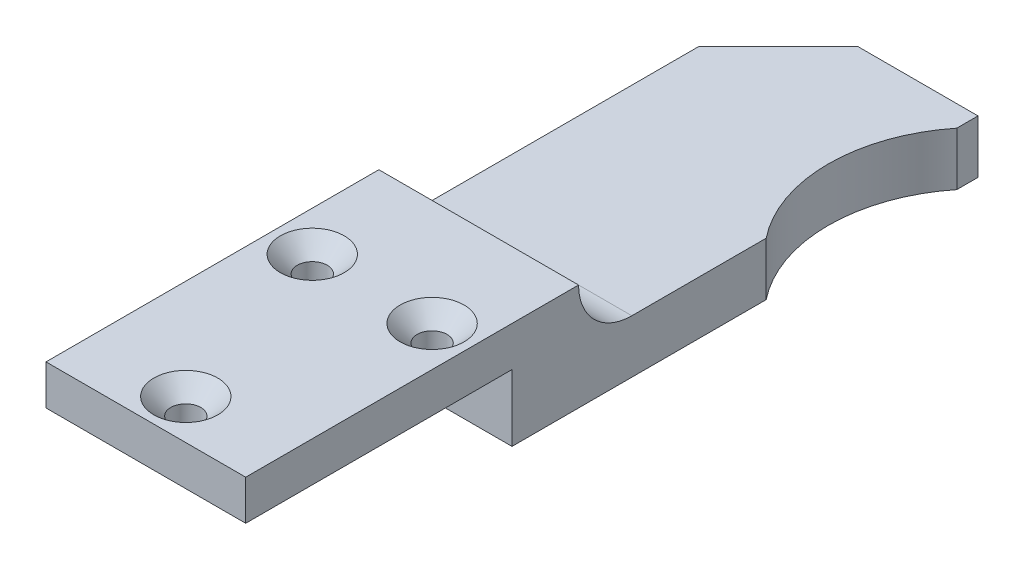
ISO-10303-21;
HEADER;
FILE_DESCRIPTION(('STEP AP214'),'2;1');
FILE_NAME('part.step','',(''),(''),'','','');
FILE_SCHEMA(('AUTOMOTIVE_DESIGN { 1 0 10303 214 1 1 1 1 }'));
ENDSEC;
DATA;
#1=APPLICATION_CONTEXT('core data for automotive mechanical design processes');
#2=APPLICATION_PROTOCOL_DEFINITION('international standard','automotive_design',2000,#1);
#3=PRODUCT_CONTEXT('',#1,'mechanical');
#4=PRODUCT('Part','Part','',(#3));
#5=PRODUCT_RELATED_PRODUCT_CATEGORY('part','',(#4));
#6=PRODUCT_DEFINITION_FORMATION('','',#4);
#7=PRODUCT_DEFINITION_CONTEXT('part definition',#1,'design');
#8=PRODUCT_DEFINITION('design','',#6,#7);
#9=PRODUCT_DEFINITION_SHAPE('','',#8);
#10=(LENGTH_UNIT() NAMED_UNIT(*) SI_UNIT(.MILLI.,.METRE.));
#11=(NAMED_UNIT(*) PLANE_ANGLE_UNIT() SI_UNIT($,.RADIAN.));
#12=(NAMED_UNIT(*) SI_UNIT($,.STERADIAN.) SOLID_ANGLE_UNIT());
#13=UNCERTAINTY_MEASURE_WITH_UNIT(LENGTH_MEASURE(1.E-05),#10,'distance_accuracy_value','');
#14=(GEOMETRIC_REPRESENTATION_CONTEXT(3) GLOBAL_UNCERTAINTY_ASSIGNED_CONTEXT((#13)) GLOBAL_UNIT_ASSIGNED_CONTEXT((#10,
#11,#12)) REPRESENTATION_CONTEXT('',''));
#15=CARTESIAN_POINT('',(0.,0.,0.));
#16=DIRECTION('',(0.,0.,1.));
#17=DIRECTION('',(1.,0.,0.));
#18=AXIS2_PLACEMENT_3D('',#15,#16,#17);
#19=CARTESIAN_POINT('',(-8.99999999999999,15.9999999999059,21.));
#20=DIRECTION('',(0.,1.,0.));
#21=DIRECTION('',(0.,0.,1.));
#22=AXIS2_PLACEMENT_3D('',#19,#20,#21);
#23=CONICAL_SURFACE('',#22,4.79999999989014,0.785398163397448);
#24=CARTESIAN_POINT('',(-8.99999999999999,15.9999999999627,21.));
#25=DIRECTION('',(0.,1.,0.));
#26=DIRECTION('',(0.,0.,1.));
#27=AXIS2_PLACEMENT_3D('',#24,#25,#26);
#28=CIRCLE('',#27,4.79999999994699);
#29=CARTESIAN_POINT('',(-8.99999999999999,15.9999999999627,25.799999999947));
#30=VERTEX_POINT('',#29);
#31=EDGE_CURVE('E20',#30,#30,#28,.F.);
#32=ORIENTED_EDGE('',*,*,#31,.F.);
#33=EDGE_LOOP('',(#32));
#34=FACE_BOUND('',#33,.T.);
#35=CARTESIAN_POINT('',(-8.99999999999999,13.45,21.));
#36=DIRECTION('',(0.,1.,0.));
#37=DIRECTION('',(0.,0.,1.));
#38=AXIS2_PLACEMENT_3D('',#35,#36,#37);
#39=CIRCLE('',#38,2.25);
#40=CARTESIAN_POINT('',(-8.99999999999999,13.45,23.25));
#41=VERTEX_POINT('',#40);
#42=EDGE_CURVE('E217',#41,#41,#39,.F.);
#43=ORIENTED_EDGE('',*,*,#42,.T.);
#44=EDGE_LOOP('',(#43));
#45=FACE_BOUND('',#44,.T.);
#46=ADVANCED_FACE('F17',(#34,#45),#23,.F.);
#47=CARTESIAN_POINT('',(9.00000000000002,15.9999999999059,21.));
#48=DIRECTION('',(0.,1.,0.));
#49=DIRECTION('',(0.,0.,1.));
#50=AXIS2_PLACEMENT_3D('',#47,#48,#49);
#51=CONICAL_SURFACE('',#50,4.79999999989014,0.785398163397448);
#52=CARTESIAN_POINT('',(9.00000000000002,15.9999999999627,21.));
#53=DIRECTION('',(0.,1.,0.));
#54=DIRECTION('',(0.,0.,1.));
#55=AXIS2_PLACEMENT_3D('',#52,#53,#54);
#56=CIRCLE('',#55,4.79999999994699);
#57=CARTESIAN_POINT('',(9.00000000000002,15.9999999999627,25.799999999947));
#58=VERTEX_POINT('',#57);
#59=EDGE_CURVE('E235',#58,#58,#56,.F.);
#60=ORIENTED_EDGE('',*,*,#59,.F.);
#61=EDGE_LOOP('',(#60));
#62=FACE_BOUND('',#61,.T.);
#63=CARTESIAN_POINT('',(9.00000000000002,13.45,21.));
#64=DIRECTION('',(0.,1.,0.));
#65=DIRECTION('',(0.,0.,1.));
#66=AXIS2_PLACEMENT_3D('',#63,#64,#65);
#67=CIRCLE('',#66,2.25);
#68=CARTESIAN_POINT('',(9.00000000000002,13.45,23.25));
#69=VERTEX_POINT('',#68);
#70=EDGE_CURVE('E214',#69,#69,#67,.F.);
#71=ORIENTED_EDGE('',*,*,#70,.T.);
#72=EDGE_LOOP('',(#71));
#73=FACE_BOUND('',#72,.T.);
#74=ADVANCED_FACE('F245',(#62,#73),#51,.F.);
#75=CARTESIAN_POINT('',(0.,15.9999999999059,49.));
#76=DIRECTION('',(0.,1.,0.));
#77=DIRECTION('',(0.,0.,1.));
#78=AXIS2_PLACEMENT_3D('',#75,#76,#77);
#79=CONICAL_SURFACE('',#78,4.79999999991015,0.785398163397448);
#80=CARTESIAN_POINT('',(0.,16.0000000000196,49.));
#81=DIRECTION('',(0.,1.,0.));
#82=DIRECTION('',(0.,0.,1.));
#83=AXIS2_PLACEMENT_3D('',#80,#81,#82);
#84=CIRCLE('',#83,4.80000000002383);
#85=CARTESIAN_POINT('',(0.,16.0000000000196,53.8000000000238));
#86=VERTEX_POINT('',#85);
#87=EDGE_CURVE('E108',#86,#86,#84,.F.);
#88=ORIENTED_EDGE('',*,*,#87,.F.);
#89=EDGE_LOOP('',(#88));
#90=FACE_BOUND('',#89,.T.);
#91=CARTESIAN_POINT('',(0.,13.45,49.));
#92=DIRECTION('',(0.,1.,0.));
#93=DIRECTION('',(0.,0.,1.));
#94=AXIS2_PLACEMENT_3D('',#91,#92,#93);
#95=CIRCLE('',#94,2.25);
#96=CARTESIAN_POINT('',(0.,13.45,51.25));
#97=VERTEX_POINT('',#96);
#98=EDGE_CURVE('E211',#97,#97,#95,.F.);
#99=ORIENTED_EDGE('',*,*,#98,.T.);
#100=EDGE_LOOP('',(#99));
#101=FACE_BOUND('',#100,.T.);
#102=ADVANCED_FACE('F251',(#90,#101),#79,.F.);
#103=CARTESIAN_POINT('',(-8.99999999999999,16.,21.));
#104=DIRECTION('',(0.,1.,0.));
#105=DIRECTION('',(0.,0.,1.));
#106=AXIS2_PLACEMENT_3D('',#103,#104,#105);
#107=CYLINDRICAL_SURFACE('',#106,2.25);
#108=CARTESIAN_POINT('',(-8.99999999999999,10.,21.));
#109=DIRECTION('',(0.,1.,0.));
#110=DIRECTION('',(0.,0.,1.));
#111=AXIS2_PLACEMENT_3D('',#108,#109,#110);
#112=CIRCLE('',#111,2.25);
#113=CARTESIAN_POINT('',(-8.99999999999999,10.,23.25));
#114=VERTEX_POINT('',#113);
#115=EDGE_CURVE('E188',#114,#114,#112,.F.);
#116=ORIENTED_EDGE('',*,*,#115,.T.);
#117=EDGE_LOOP('',(#116));
#118=FACE_BOUND('',#117,.T.);
#119=ORIENTED_EDGE('',*,*,#42,.F.);
#120=EDGE_LOOP('',(#119));
#121=FACE_BOUND('',#120,.T.);
#122=ADVANCED_FACE('F248',(#118,#121),#107,.F.);
#123=CARTESIAN_POINT('',(9.00000000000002,16.,21.));
#124=DIRECTION('',(0.,1.,0.));
#125=DIRECTION('',(0.,0.,1.));
#126=AXIS2_PLACEMENT_3D('',#123,#124,#125);
#127=CYLINDRICAL_SURFACE('',#126,2.25);
#128=CARTESIAN_POINT('',(9.00000000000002,10.,21.));
#129=DIRECTION('',(0.,1.,0.));
#130=DIRECTION('',(0.,0.,1.));
#131=AXIS2_PLACEMENT_3D('',#128,#129,#130);
#132=CIRCLE('',#131,2.25);
#133=CARTESIAN_POINT('',(9.00000000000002,10.,23.25));
#134=VERTEX_POINT('',#133);
#135=EDGE_CURVE('E229',#134,#134,#132,.F.);
#136=ORIENTED_EDGE('',*,*,#135,.T.);
#137=EDGE_LOOP('',(#136));
#138=FACE_BOUND('',#137,.T.);
#139=ORIENTED_EDGE('',*,*,#70,.F.);
#140=EDGE_LOOP('',(#139));
#141=FACE_BOUND('',#140,.T.);
#142=ADVANCED_FACE('F250',(#138,#141),#127,.F.);
#143=CARTESIAN_POINT('',(0.,16.,49.));
#144=DIRECTION('',(0.,1.,0.));
#145=DIRECTION('',(0.,0.,1.));
#146=AXIS2_PLACEMENT_3D('',#143,#144,#145);
#147=CYLINDRICAL_SURFACE('',#146,2.25);
#148=CARTESIAN_POINT('',(0.,10.,49.));
#149=DIRECTION('',(0.,1.,0.));
#150=DIRECTION('',(0.,0.,1.));
#151=AXIS2_PLACEMENT_3D('',#148,#149,#150);
#152=CIRCLE('',#151,2.25);
#153=CARTESIAN_POINT('',(0.,10.,51.25));
#154=VERTEX_POINT('',#153);
#155=EDGE_CURVE('E179',#154,#154,#152,.F.);
#156=ORIENTED_EDGE('',*,*,#155,.T.);
#157=EDGE_LOOP('',(#156));
#158=FACE_BOUND('',#157,.T.);
#159=ORIENTED_EDGE('',*,*,#98,.F.);
#160=EDGE_LOOP('',(#159));
#161=FACE_BOUND('',#160,.T.);
#162=ADVANCED_FACE('F259',(#158,#161),#147,.F.);
#163=CARTESIAN_POINT('',(-31.6877512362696,16.,-3.));
#164=DIRECTION('',(1.,0.,0.));
#165=DIRECTION('',(0.,0.,-1.));
#166=AXIS2_PLACEMENT_3D('',#163,#164,#165);
#167=CYLINDRICAL_SURFACE('',#166,8.);
#168=DIRECTION('',(1.,0.,0.));
#169=VECTOR('',#168,1.);
#170=CARTESIAN_POINT('',(0.,16.,4.99999999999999));
#171=LINE('',#170,#169);
#172=CARTESIAN_POINT('',(15.,16.,4.99999999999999));
#173=VERTEX_POINT('',#172);
#174=CARTESIAN_POINT('',(-15.,16.,4.99999999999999));
#175=VERTEX_POINT('',#174);
#176=EDGE_CURVE('E97',#173,#175,#171,.F.);
#177=ORIENTED_EDGE('',*,*,#176,.F.);
#178=CARTESIAN_POINT('',(15.,16.,-3.00000000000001));
#179=DIRECTION('',(1.,0.,0.));
#180=DIRECTION('',(0.,0.,-1.));
#181=AXIS2_PLACEMENT_3D('',#178,#179,#180);
#182=CIRCLE('',#181,8.);
#183=CARTESIAN_POINT('',(15.,7.99999999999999,-3.00000000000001));
#184=VERTEX_POINT('',#183);
#185=EDGE_CURVE('E101',#173,#184,#182,.T.);
#186=ORIENTED_EDGE('',*,*,#185,.T.);
#187=DIRECTION('',(1.,0.,0.));
#188=VECTOR('',#187,1.);
#189=CARTESIAN_POINT('',(-15.,7.99999999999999,-3.));
#190=LINE('',#189,#188);
#191=CARTESIAN_POINT('',(-15.,8.,-3.));
#192=VERTEX_POINT('',#191);
#193=EDGE_CURVE('E154',#184,#192,#190,.F.);
#194=ORIENTED_EDGE('',*,*,#193,.T.);
#195=CARTESIAN_POINT('',(-15.,16.,-3.));
#196=DIRECTION('',(1.,0.,0.));
#197=DIRECTION('',(0.,0.,-1.));
#198=AXIS2_PLACEMENT_3D('',#195,#196,#197);
#199=CIRCLE('',#198,8.);
#200=EDGE_CURVE('E102',#192,#175,#199,.F.);
#201=ORIENTED_EDGE('',*,*,#200,.T.);
#202=EDGE_LOOP('',(#177,#186,#194,#201));
#203=FACE_BOUND('',#202,.T.);
#204=ADVANCED_FACE('F99',(#203),#167,.F.);
#205=CARTESIAN_POINT('',(0.,16.,0.));
#206=DIRECTION('',(0.,1.,0.));
#207=DIRECTION('',(0.,0.,1.));
#208=AXIS2_PLACEMENT_3D('',#205,#206,#207);
#209=PLANE('',#208);
#210=DIRECTION('',(0.,0.,-1.));
#211=VECTOR('',#210,1.);
#212=CARTESIAN_POINT('',(-15.,16.,-55.));
#213=LINE('',#212,#211);
#214=CARTESIAN_POINT('',(-15.,16.,55.));
#215=VERTEX_POINT('',#214);
#216=EDGE_CURVE('E184',#175,#215,#213,.F.);
#217=ORIENTED_EDGE('',*,*,#216,.T.);
#218=DIRECTION('',(-1.,0.,0.));
#219=VECTOR('',#218,1.);
#220=CARTESIAN_POINT('',(-15.,16.,55.));
#221=LINE('',#220,#219);
#222=CARTESIAN_POINT('',(15.,16.,55.));
#223=VERTEX_POINT('',#222);
#224=EDGE_CURVE('E107',#215,#223,#221,.F.);
#225=ORIENTED_EDGE('',*,*,#224,.T.);
#226=DIRECTION('',(0.,0.,1.));
#227=VECTOR('',#226,1.);
#228=CARTESIAN_POINT('',(15.,16.,-55.));
#229=LINE('',#228,#227);
#230=EDGE_CURVE('E115',#223,#173,#229,.F.);
#231=ORIENTED_EDGE('',*,*,#230,.T.);
#232=ORIENTED_EDGE('',*,*,#176,.T.);
#233=EDGE_LOOP('',(#217,#225,#231,#232));
#234=FACE_BOUND('',#233,.T.);
#235=ORIENTED_EDGE('',*,*,#87,.T.);
#236=EDGE_LOOP('',(#235));
#237=FACE_BOUND('',#236,.T.);
#238=ORIENTED_EDGE('',*,*,#59,.T.);
#239=EDGE_LOOP('',(#238));
#240=FACE_BOUND('',#239,.T.);
#241=ORIENTED_EDGE('',*,*,#31,.T.);
#242=EDGE_LOOP('',(#241));
#243=FACE_BOUND('',#242,.T.);
#244=ADVANCED_FACE('F121',(#234,#237,#240,#243),#209,.T.);
#245=CARTESIAN_POINT('',(-15.,16.,55.));
#246=DIRECTION('',(0.,0.,-1.));
#247=DIRECTION('',(-1.,0.,0.));
#248=AXIS2_PLACEMENT_3D('',#245,#246,#247);
#249=PLANE('',#248);
#250=DIRECTION('',(1.,0.,0.));
#251=VECTOR('',#250,1.);
#252=CARTESIAN_POINT('',(-15.,10.,55.));
#253=LINE('',#252,#251);
#254=CARTESIAN_POINT('',(-15.,10.,55.));
#255=VERTEX_POINT('',#254);
#256=CARTESIAN_POINT('',(15.,10.,55.));
#257=VERTEX_POINT('',#256);
#258=EDGE_CURVE('E156',#255,#257,#253,.T.);
#259=ORIENTED_EDGE('',*,*,#258,.T.);
#260=DIRECTION('',(0.,1.,0.));
#261=VECTOR('',#260,1.);
#262=CARTESIAN_POINT('',(15.,16.,55.));
#263=LINE('',#262,#261);
#264=EDGE_CURVE('E123',#257,#223,#263,.T.);
#265=ORIENTED_EDGE('',*,*,#264,.T.);
#266=ORIENTED_EDGE('',*,*,#224,.F.);
#267=DIRECTION('',(0.,1.,0.));
#268=VECTOR('',#267,1.);
#269=CARTESIAN_POINT('',(-15.,16.,55.));
#270=LINE('',#269,#268);
#271=EDGE_CURVE('E175',#215,#255,#270,.F.);
#272=ORIENTED_EDGE('',*,*,#271,.T.);
#273=EDGE_LOOP('',(#259,#265,#266,#272));
#274=FACE_BOUND('',#273,.T.);
#275=ADVANCED_FACE('F304',(#274),#249,.F.);
#276=CARTESIAN_POINT('',(-15.,10.,55.));
#277=DIRECTION('',(0.,1.,0.));
#278=DIRECTION('',(0.,0.,1.));
#279=AXIS2_PLACEMENT_3D('',#276,#277,#278);
#280=PLANE('',#279);
#281=ORIENTED_EDGE('',*,*,#258,.F.);
#282=DIRECTION('',(0.,0.,-1.));
#283=VECTOR('',#282,1.);
#284=CARTESIAN_POINT('',(-15.,10.,-55.));
#285=LINE('',#284,#283);
#286=CARTESIAN_POINT('',(-15.,10.,15.));
#287=VERTEX_POINT('',#286);
#288=EDGE_CURVE('E149',#255,#287,#285,.T.);
#289=ORIENTED_EDGE('',*,*,#288,.T.);
#290=DIRECTION('',(-1.,0.,0.));
#291=VECTOR('',#290,1.);
#292=CARTESIAN_POINT('',(-15.,10.,15.));
#293=LINE('',#292,#291);
#294=CARTESIAN_POINT('',(15.,10.,15.));
#295=VERTEX_POINT('',#294);
#296=EDGE_CURVE('E134',#287,#295,#293,.F.);
#297=ORIENTED_EDGE('',*,*,#296,.T.);
#298=DIRECTION('',(0.,0.,1.));
#299=VECTOR('',#298,1.);
#300=CARTESIAN_POINT('',(15.,10.,-55.));
#301=LINE('',#300,#299);
#302=EDGE_CURVE('E125',#295,#257,#301,.T.);
#303=ORIENTED_EDGE('',*,*,#302,.T.);
#304=EDGE_LOOP('',(#281,#289,#297,#303));
#305=FACE_BOUND('',#304,.T.);
#306=ORIENTED_EDGE('',*,*,#155,.F.);
#307=EDGE_LOOP('',(#306));
#308=FACE_BOUND('',#307,.T.);
#309=ORIENTED_EDGE('',*,*,#135,.F.);
#310=EDGE_LOOP('',(#309));
#311=FACE_BOUND('',#310,.T.);
#312=ORIENTED_EDGE('',*,*,#115,.F.);
#313=EDGE_LOOP('',(#312));
#314=FACE_BOUND('',#313,.T.);
#315=ADVANCED_FACE('F300',(#305,#308,#311,#314),#280,.F.);
#316=CARTESIAN_POINT('',(-15.,8.,-55.));
#317=DIRECTION('',(0.,-1.,0.));
#318=DIRECTION('',(0.,0.,-1.));
#319=AXIS2_PLACEMENT_3D('',#316,#317,#318);
#320=PLANE('',#319);
#321=DIRECTION('',(0.707106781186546,0.,-0.707106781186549));
#322=VECTOR('',#321,1.);
#323=CARTESIAN_POINT('',(-3.,8.,-55.));
#324=LINE('',#323,#322);
#325=CARTESIAN_POINT('',(-3.,8.,-55.));
#326=VERTEX_POINT('',#325);
#327=CARTESIAN_POINT('',(-15.,8.,-43.));
#328=VERTEX_POINT('',#327);
#329=EDGE_CURVE('E160',#326,#328,#324,.F.);
#330=ORIENTED_EDGE('',*,*,#329,.T.);
#331=DIRECTION('',(0.,0.,-1.));
#332=VECTOR('',#331,1.);
#333=CARTESIAN_POINT('',(-15.,8.,-55.));
#334=LINE('',#333,#332);
#335=EDGE_CURVE('E143',#328,#192,#334,.F.);
#336=ORIENTED_EDGE('',*,*,#335,.T.);
#337=ORIENTED_EDGE('',*,*,#193,.F.);
#338=DIRECTION('',(0.,0.,1.));
#339=VECTOR('',#338,1.);
#340=CARTESIAN_POINT('',(15.,7.99999999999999,-55.));
#341=LINE('',#340,#339);
#342=CARTESIAN_POINT('',(15.,8.,-23.1821789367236));
#343=VERTEX_POINT('',#342);
#344=EDGE_CURVE('E118',#184,#343,#341,.F.);
#345=ORIENTED_EDGE('',*,*,#344,.T.);
#346=CARTESIAN_POINT('',(33.,8.,-37.5));
#347=DIRECTION('',(0.,1.,0.));
#348=DIRECTION('',(0.,0.,1.));
#349=AXIS2_PLACEMENT_3D('',#346,#347,#348);
#350=CIRCLE('',#349,23.);
#351=CARTESIAN_POINT('',(15.,8.,-51.8178210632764));
#352=VERTEX_POINT('',#351);
#353=EDGE_CURVE('E225',#343,#352,#350,.F.);
#354=ORIENTED_EDGE('',*,*,#353,.T.);
#355=DIRECTION('',(0.,0.,1.));
#356=VECTOR('',#355,1.);
#357=CARTESIAN_POINT('',(15.,8.,-55.));
#358=LINE('',#357,#356);
#359=CARTESIAN_POINT('',(15.,8.,-55.));
#360=VERTEX_POINT('',#359);
#361=EDGE_CURVE('E200',#352,#360,#358,.F.);
#362=ORIENTED_EDGE('',*,*,#361,.T.);
#363=DIRECTION('',(1.,0.,0.));
#364=VECTOR('',#363,1.);
#365=CARTESIAN_POINT('',(-15.,8.,-55.));
#366=LINE('',#365,#364);
#367=EDGE_CURVE('E193',#360,#326,#366,.F.);
#368=ORIENTED_EDGE('',*,*,#367,.T.);
#369=EDGE_LOOP('',(#330,#336,#337,#345,#354,#362,#368));
#370=FACE_BOUND('',#369,.T.);
#371=ADVANCED_FACE('F296',(#370),#320,.F.);
#372=CARTESIAN_POINT('',(-15.,0.,15.));
#373=DIRECTION('',(0.,0.,-1.));
#374=DIRECTION('',(-1.,0.,0.));
#375=AXIS2_PLACEMENT_3D('',#372,#373,#374);
#376=PLANE('',#375);
#377=DIRECTION('',(0.,1.,0.));
#378=VECTOR('',#377,1.);
#379=CARTESIAN_POINT('',(-15.,16.,15.));
#380=LINE('',#379,#378);
#381=CARTESIAN_POINT('',(-15.,0.,15.));
#382=VERTEX_POINT('',#381);
#383=EDGE_CURVE('E146',#287,#382,#380,.F.);
#384=ORIENTED_EDGE('',*,*,#383,.T.);
#385=DIRECTION('',(1.,0.,0.));
#386=VECTOR('',#385,1.);
#387=CARTESIAN_POINT('',(0.,0.,15.));
#388=LINE('',#387,#386);
#389=CARTESIAN_POINT('',(15.,0.,15.));
#390=VERTEX_POINT('',#389);
#391=EDGE_CURVE('E139',#382,#390,#388,.T.);
#392=ORIENTED_EDGE('',*,*,#391,.T.);
#393=DIRECTION('',(0.,1.,0.));
#394=VECTOR('',#393,1.);
#395=CARTESIAN_POINT('',(15.,16.,15.));
#396=LINE('',#395,#394);
#397=EDGE_CURVE('E133',#390,#295,#396,.T.);
#398=ORIENTED_EDGE('',*,*,#397,.T.);
#399=ORIENTED_EDGE('',*,*,#296,.F.);
#400=EDGE_LOOP('',(#384,#392,#398,#399));
#401=FACE_BOUND('',#400,.T.);
#402=ADVANCED_FACE('F293',(#401),#376,.F.);
#403=CARTESIAN_POINT('',(15.,16.,-55.));
#404=DIRECTION('',(-1.,0.,0.));
#405=DIRECTION('',(0.,0.,1.));
#406=AXIS2_PLACEMENT_3D('',#403,#404,#405);
#407=PLANE('',#406);
#408=ORIENTED_EDGE('',*,*,#230,.F.);
#409=ORIENTED_EDGE('',*,*,#264,.F.);
#410=ORIENTED_EDGE('',*,*,#302,.F.);
#411=ORIENTED_EDGE('',*,*,#397,.F.);
#412=DIRECTION('',(0.,0.,1.));
#413=VECTOR('',#412,1.);
#414=CARTESIAN_POINT('',(15.,0.,0.));
#415=LINE('',#414,#413);
#416=CARTESIAN_POINT('',(15.,0.,-23.1821789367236));
#417=VERTEX_POINT('',#416);
#418=EDGE_CURVE('E142',#390,#417,#415,.F.);
#419=ORIENTED_EDGE('',*,*,#418,.T.);
#420=DIRECTION('',(0.,1.,0.));
#421=VECTOR('',#420,1.);
#422=CARTESIAN_POINT('',(15.,0.,-23.1821789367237));
#423=LINE('',#422,#421);
#424=EDGE_CURVE('E119',#417,#343,#423,.T.);
#425=ORIENTED_EDGE('',*,*,#424,.T.);
#426=ORIENTED_EDGE('',*,*,#344,.F.);
#427=ORIENTED_EDGE('',*,*,#185,.F.);
#428=EDGE_LOOP('',(#408,#409,#410,#411,#419,#425,#426,#427));
#429=FACE_BOUND('',#428,.T.);
#430=ADVANCED_FACE('F113',(#429),#407,.F.);
#431=CARTESIAN_POINT('',(33.,0.,-37.5));
#432=DIRECTION('',(0.,1.,0.));
#433=DIRECTION('',(0.,0.,1.));
#434=AXIS2_PLACEMENT_3D('',#431,#432,#433);
#435=CYLINDRICAL_SURFACE('',#434,23.);
#436=DIRECTION('',(0.,1.,0.));
#437=VECTOR('',#436,1.);
#438=CARTESIAN_POINT('',(15.,16.,-51.8178210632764));
#439=LINE('',#438,#437);
#440=CARTESIAN_POINT('',(15.,0.,-51.8178210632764));
#441=VERTEX_POINT('',#440);
#442=EDGE_CURVE('E202',#441,#352,#439,.T.);
#443=ORIENTED_EDGE('',*,*,#442,.T.);
#444=ORIENTED_EDGE('',*,*,#353,.F.);
#445=ORIENTED_EDGE('',*,*,#424,.F.);
#446=CARTESIAN_POINT('',(33.,0.,-37.5));
#447=DIRECTION('',(0.,1.,0.));
#448=DIRECTION('',(0.,0.,1.));
#449=AXIS2_PLACEMENT_3D('',#446,#447,#448);
#450=CIRCLE('',#449,23.);
#451=EDGE_CURVE('E220',#417,#441,#450,.F.);
#452=ORIENTED_EDGE('',*,*,#451,.T.);
#453=EDGE_LOOP('',(#443,#444,#445,#452));
#454=FACE_BOUND('',#453,.T.);
#455=ADVANCED_FACE('F286',(#454),#435,.F.);
#456=CARTESIAN_POINT('',(15.,16.,-55.));
#457=DIRECTION('',(-1.,0.,0.));
#458=DIRECTION('',(0.,0.,1.));
#459=AXIS2_PLACEMENT_3D('',#456,#457,#458);
#460=PLANE('',#459);
#461=ORIENTED_EDGE('',*,*,#442,.F.);
#462=DIRECTION('',(0.,0.,1.));
#463=VECTOR('',#462,1.);
#464=CARTESIAN_POINT('',(15.,0.,0.));
#465=LINE('',#464,#463);
#466=CARTESIAN_POINT('',(15.,0.,-55.));
#467=VERTEX_POINT('',#466);
#468=EDGE_CURVE('E223',#441,#467,#465,.F.);
#469=ORIENTED_EDGE('',*,*,#468,.T.);
#470=DIRECTION('',(0.,1.,0.));
#471=VECTOR('',#470,1.);
#472=CARTESIAN_POINT('',(15.,16.,-55.));
#473=LINE('',#472,#471);
#474=EDGE_CURVE('E197',#467,#360,#473,.T.);
#475=ORIENTED_EDGE('',*,*,#474,.T.);
#476=ORIENTED_EDGE('',*,*,#361,.F.);
#477=EDGE_LOOP('',(#461,#469,#475,#476));
#478=FACE_BOUND('',#477,.T.);
#479=ADVANCED_FACE('F282',(#478),#460,.F.);
#480=CARTESIAN_POINT('',(-15.,16.,-55.));
#481=DIRECTION('',(0.,0.,1.));
#482=DIRECTION('',(1.,0.,0.));
#483=AXIS2_PLACEMENT_3D('',#480,#481,#482);
#484=PLANE('',#483);
#485=DIRECTION('',(0.,1.,0.));
#486=VECTOR('',#485,1.);
#487=CARTESIAN_POINT('',(-3.,16.,-55.));
#488=LINE('',#487,#486);
#489=CARTESIAN_POINT('',(-3.,0.,-55.));
#490=VERTEX_POINT('',#489);
#491=EDGE_CURVE('E162',#490,#326,#488,.T.);
#492=ORIENTED_EDGE('',*,*,#491,.T.);
#493=ORIENTED_EDGE('',*,*,#367,.F.);
#494=ORIENTED_EDGE('',*,*,#474,.F.);
#495=DIRECTION('',(1.,0.,0.));
#496=VECTOR('',#495,1.);
#497=CARTESIAN_POINT('',(0.,0.,-55.));
#498=LINE('',#497,#496);
#499=EDGE_CURVE('E167',#467,#490,#498,.F.);
#500=ORIENTED_EDGE('',*,*,#499,.T.);
#501=EDGE_LOOP('',(#492,#493,#494,#500));
#502=FACE_BOUND('',#501,.T.);
#503=ADVANCED_FACE('F278',(#502),#484,.F.);
#504=CARTESIAN_POINT('',(-3.,16.,-55.));
#505=DIRECTION('',(0.707106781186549,0.,0.707106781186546));
#506=DIRECTION('',(0.707106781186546,0.,-0.707106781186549));
#507=AXIS2_PLACEMENT_3D('',#504,#505,#506);
#508=PLANE('',#507);
#509=DIRECTION('',(0.,1.,0.));
#510=VECTOR('',#509,1.);
#511=CARTESIAN_POINT('',(-15.,16.,-43.));
#512=LINE('',#511,#510);
#513=CARTESIAN_POINT('',(-15.,0.,-43.));
#514=VERTEX_POINT('',#513);
#515=EDGE_CURVE('E34',#514,#328,#512,.T.);
#516=ORIENTED_EDGE('',*,*,#515,.T.);
#517=ORIENTED_EDGE('',*,*,#329,.F.);
#518=ORIENTED_EDGE('',*,*,#491,.F.);
#519=DIRECTION('',(-0.707106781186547,0.,0.707106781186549));
#520=VECTOR('',#519,1.);
#521=CARTESIAN_POINT('',(-3.,0.,-55.));
#522=LINE('',#521,#520);
#523=EDGE_CURVE('E26',#490,#514,#522,.T.);
#524=ORIENTED_EDGE('',*,*,#523,.T.);
#525=EDGE_LOOP('',(#516,#517,#518,#524));
#526=FACE_BOUND('',#525,.T.);
#527=ADVANCED_FACE('F272',(#526),#508,.F.);
#528=CARTESIAN_POINT('',(-15.,16.,-55.));
#529=DIRECTION('',(1.,0.,0.));
#530=DIRECTION('',(0.,0.,-1.));
#531=AXIS2_PLACEMENT_3D('',#528,#529,#530);
#532=PLANE('',#531);
#533=ORIENTED_EDGE('',*,*,#515,.F.);
#534=DIRECTION('',(0.,0.,1.));
#535=VECTOR('',#534,1.);
#536=CARTESIAN_POINT('',(-15.,0.,0.));
#537=LINE('',#536,#535);
#538=EDGE_CURVE('E11',#514,#382,#537,.T.);
#539=ORIENTED_EDGE('',*,*,#538,.T.);
#540=ORIENTED_EDGE('',*,*,#383,.F.);
#541=ORIENTED_EDGE('',*,*,#288,.F.);
#542=ORIENTED_EDGE('',*,*,#271,.F.);
#543=ORIENTED_EDGE('',*,*,#216,.F.);
#544=ORIENTED_EDGE('',*,*,#200,.F.);
#545=ORIENTED_EDGE('',*,*,#335,.F.);
#546=EDGE_LOOP('',(#533,#539,#540,#541,#542,#543,#544,#545));
#547=FACE_BOUND('',#546,.T.);
#548=ADVANCED_FACE('F266',(#547),#532,.F.);
#549=CARTESIAN_POINT('',(0.,0.,0.));
#550=DIRECTION('',(0.,1.,0.));
#551=DIRECTION('',(0.,0.,1.));
#552=AXIS2_PLACEMENT_3D('',#549,#550,#551);
#553=PLANE('',#552);
#554=ORIENTED_EDGE('',*,*,#523,.F.);
#555=ORIENTED_EDGE('',*,*,#499,.F.);
#556=ORIENTED_EDGE('',*,*,#468,.F.);
#557=ORIENTED_EDGE('',*,*,#451,.F.);
#558=ORIENTED_EDGE('',*,*,#418,.F.);
#559=ORIENTED_EDGE('',*,*,#391,.F.);
#560=ORIENTED_EDGE('',*,*,#538,.F.);
#561=EDGE_LOOP('',(#554,#555,#556,#557,#558,#559,#560));
#562=FACE_BOUND('',#561,.T.);
#563=ADVANCED_FACE('F264',(#562),#553,.F.);
#564=CLOSED_SHELL('',(#46,#74,#102,#122,#142,#162,#204,#244,#275,#315,#371,#402,#430,#455,#479,
#503,#527,#548,#563));
#565=MANIFOLD_SOLID_BREP('B1',#564);
#566=ADVANCED_BREP_SHAPE_REPRESENTATION('',(#18,#565),#14);
#567=SHAPE_DEFINITION_REPRESENTATION(#9,#566);
ENDSEC;
END-ISO-10303-21;
